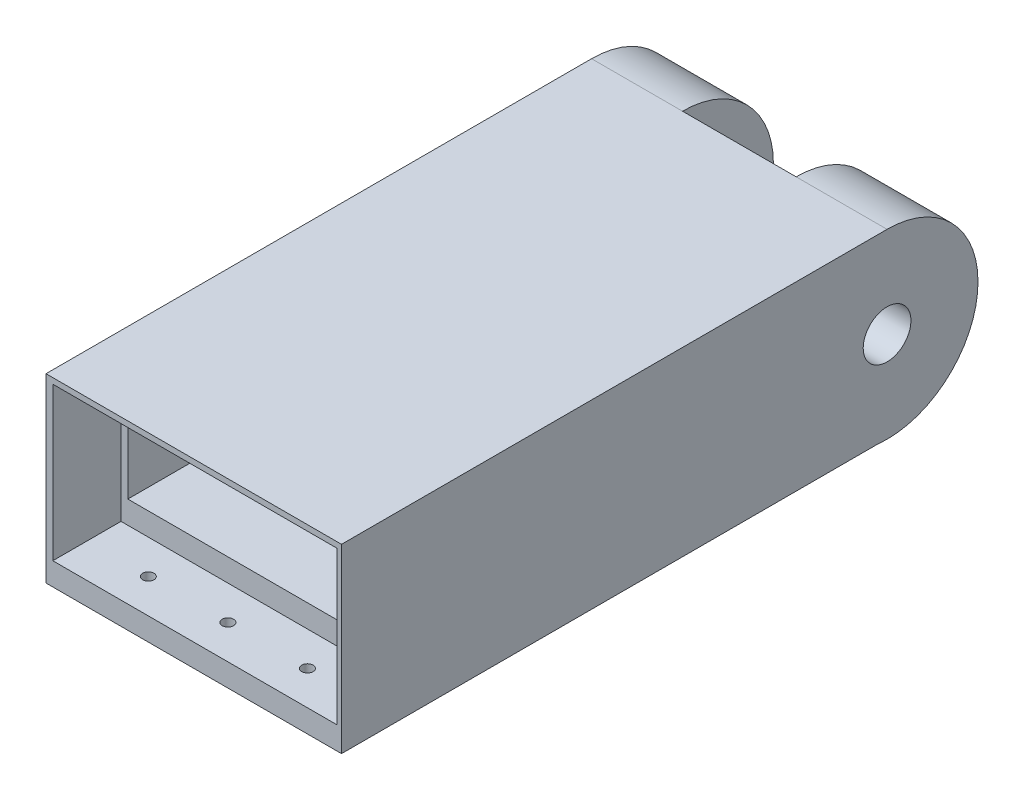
ISO-10303-21;
HEADER;
FILE_DESCRIPTION(('STEP AP214'),'2;1');
FILE_NAME('part.step','',(''),(''),'','','');
FILE_SCHEMA(('AUTOMOTIVE_DESIGN { 1 0 10303 214 1 1 1 1 }'));
ENDSEC;
DATA;
#1=APPLICATION_CONTEXT('core data for automotive mechanical design processes');
#2=APPLICATION_PROTOCOL_DEFINITION('international standard','automotive_design',2000,#1);
#3=PRODUCT_CONTEXT('',#1,'mechanical');
#4=PRODUCT('Part','Part','',(#3));
#5=PRODUCT_RELATED_PRODUCT_CATEGORY('part','',(#4));
#6=PRODUCT_DEFINITION_FORMATION('','',#4);
#7=PRODUCT_DEFINITION_CONTEXT('part definition',#1,'design');
#8=PRODUCT_DEFINITION('design','',#6,#7);
#9=PRODUCT_DEFINITION_SHAPE('','',#8);
#10=(LENGTH_UNIT() NAMED_UNIT(*) SI_UNIT(.MILLI.,.METRE.));
#11=(NAMED_UNIT(*) PLANE_ANGLE_UNIT() SI_UNIT($,.RADIAN.));
#12=(NAMED_UNIT(*) SI_UNIT($,.STERADIAN.) SOLID_ANGLE_UNIT());
#13=UNCERTAINTY_MEASURE_WITH_UNIT(LENGTH_MEASURE(1.E-05),#10,'distance_accuracy_value','');
#14=(GEOMETRIC_REPRESENTATION_CONTEXT(3) GLOBAL_UNCERTAINTY_ASSIGNED_CONTEXT((#13)) GLOBAL_UNIT_ASSIGNED_CONTEXT((#10,
#11,#12)) REPRESENTATION_CONTEXT('',''));
#15=CARTESIAN_POINT('',(0.,0.,0.));
#16=DIRECTION('',(0.,0.,1.));
#17=DIRECTION('',(1.,0.,0.));
#18=AXIS2_PLACEMENT_3D('',#15,#16,#17);
#19=CARTESIAN_POINT('',(7.69760634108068,102.517395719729,1190.00000000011));
#20=DIRECTION('',(-1.,0.,0.));
#21=DIRECTION('',(0.,0.,1.));
#22=AXIS2_PLACEMENT_3D('',#19,#20,#21);
#23=CYLINDRICAL_SURFACE('',#22,39.9999999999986);
#24=CARTESIAN_POINT('',(-32.3023936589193,102.517395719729,1190.00000000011));
#25=DIRECTION('',(1.,0.,0.));
#26=DIRECTION('',(0.,0.,1.));
#27=AXIS2_PLACEMENT_3D('',#24,#25,#26);
#28=CIRCLE('',#27,39.9999999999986);
#29=CARTESIAN_POINT('',(-32.3023936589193,62.7507169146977,1194.31407658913));
#30=VERTEX_POINT('',#29);
#31=CARTESIAN_POINT('',(-32.3023936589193,142.517395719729,1190.00000000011));
#32=VERTEX_POINT('',#31);
#33=EDGE_CURVE('E330',#30,#32,#28,.T.);
#34=ORIENTED_EDGE('',*,*,#33,.T.);
#35=DIRECTION('',(-1.,0.,0.));
#36=VECTOR('',#35,1.);
#37=CARTESIAN_POINT('',(7.69760634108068,142.517395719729,1190.00000000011));
#38=LINE('',#37,#36);
#39=CARTESIAN_POINT('',(7.69760634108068,142.517395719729,1190.00000000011));
#40=VERTEX_POINT('',#39);
#41=EDGE_CURVE('E12',#40,#32,#38,.T.);
#42=ORIENTED_EDGE('',*,*,#41,.F.);
#43=CARTESIAN_POINT('',(7.69760634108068,102.517395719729,1190.00000000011));
#44=DIRECTION('',(1.,0.,0.));
#45=DIRECTION('',(0.,0.,1.));
#46=AXIS2_PLACEMENT_3D('',#43,#44,#45);
#47=CIRCLE('',#46,39.9999999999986);
#48=CARTESIAN_POINT('',(7.69760634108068,62.7507169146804,1194.31407658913));
#49=VERTEX_POINT('',#48);
#50=EDGE_CURVE('E331',#49,#40,#47,.T.);
#51=ORIENTED_EDGE('',*,*,#50,.F.);
#52=DIRECTION('',(-1.,0.,0.));
#53=VECTOR('',#52,1.);
#54=CARTESIAN_POINT('',(7.69760634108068,62.7507169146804,1194.31407658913));
#55=LINE('',#54,#53);
#56=EDGE_CURVE('E49',#49,#30,#55,.T.);
#57=ORIENTED_EDGE('',*,*,#56,.T.);
#58=EDGE_LOOP('',(#34,#42,#51,#57));
#59=FACE_BOUND('',#58,.T.);
#60=ADVANCED_FACE('F41',(#59),#23,.T.);
#61=CARTESIAN_POINT('',(7.69760634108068,142.517395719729,1190.00000000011));
#62=DIRECTION('',(0.,-1.,0.));
#63=DIRECTION('',(0.,0.,-1.));
#64=AXIS2_PLACEMENT_3D('',#61,#62,#63);
#65=PLANE('',#64);
#66=ORIENTED_EDGE('',*,*,#41,.T.);
#67=DIRECTION('',(1.,0.,0.));
#68=VECTOR('',#67,1.);
#69=CARTESIAN_POINT('',(-82.3023936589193,142.51739571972,1190.00000000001));
#70=LINE('',#69,#68);
#71=CARTESIAN_POINT('',(-82.3023936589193,142.51739571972,1190.00000000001));
#72=VERTEX_POINT('',#71);
#73=EDGE_CURVE('E323',#72,#32,#70,.T.);
#74=ORIENTED_EDGE('',*,*,#73,.F.);
#75=DIRECTION('',(1.,0.,0.));
#76=VECTOR('',#75,1.);
#77=CARTESIAN_POINT('',(-122.302393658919,142.51739571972,1190.00000000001));
#78=LINE('',#77,#76);
#79=CARTESIAN_POINT('',(-122.302393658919,142.51739571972,1190.00000000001));
#80=VERTEX_POINT('',#79);
#81=EDGE_CURVE('E306',#80,#72,#78,.T.);
#82=ORIENTED_EDGE('',*,*,#81,.F.);
#83=DIRECTION('',(0.,0.,-1.));
#84=VECTOR('',#83,1.);
#85=CARTESIAN_POINT('',(-122.302393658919,142.51739571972,1190.00000000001));
#86=LINE('',#85,#84);
#87=CARTESIAN_POINT('',(-122.30239365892,142.51739571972,1430.00000000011));
#88=VERTEX_POINT('',#87);
#89=EDGE_CURVE('E304',#88,#80,#86,.T.);
#90=ORIENTED_EDGE('',*,*,#89,.F.);
#91=DIRECTION('',(-1.,0.,0.));
#92=VECTOR('',#91,1.);
#93=CARTESIAN_POINT('',(-122.30239365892,142.51739571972,1430.00000000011));
#94=LINE('',#93,#92);
#95=CARTESIAN_POINT('',(7.69760634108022,142.51739571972,1430.00000000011));
#96=VERTEX_POINT('',#95);
#97=EDGE_CURVE('E229',#96,#88,#94,.T.);
#98=ORIENTED_EDGE('',*,*,#97,.F.);
#99=DIRECTION('',(0.,0.,1.));
#100=VECTOR('',#99,1.);
#101=CARTESIAN_POINT('',(7.69760634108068,142.517395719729,1190.00000000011));
#102=LINE('',#101,#100);
#103=EDGE_CURVE('E334',#40,#96,#102,.T.);
#104=ORIENTED_EDGE('',*,*,#103,.F.);
#105=EDGE_LOOP('',(#66,#74,#82,#90,#98,#104));
#106=FACE_BOUND('',#105,.T.);
#107=ADVANCED_FACE('F358',(#106),#65,.F.);
#108=CARTESIAN_POINT('',(7.6976063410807,142.517395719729,1400.00000000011));
#109=DIRECTION('',(0.,0.,-1.));
#110=DIRECTION('',(-1.,0.,0.));
#111=AXIS2_PLACEMENT_3D('',#108,#109,#110);
#112=PLANE('',#111);
#113=DIRECTION('',(-1.,0.,0.));
#114=VECTOR('',#113,1.);
#115=CARTESIAN_POINT('',(-119.30239365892,140.01739571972,1400.00000000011));
#116=LINE('',#115,#114);
#117=CARTESIAN_POINT('',(5.77293715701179,140.01739571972,1400.00000000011));
#118=VERTEX_POINT('',#117);
#119=CARTESIAN_POINT('',(-119.30239365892,140.01739571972,1400.00000000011));
#120=VERTEX_POINT('',#119);
#121=EDGE_CURVE('E188',#118,#120,#116,.T.);
#122=ORIENTED_EDGE('',*,*,#121,.T.);
#123=DIRECTION('',(0.,-1.,0.));
#124=VECTOR('',#123,1.);
#125=CARTESIAN_POINT('',(-119.30239365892,140.01739571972,1400.00000000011));
#126=LINE('',#125,#124);
#127=CARTESIAN_POINT('',(-119.302393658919,72.7507169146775,1400.00000000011));
#128=VERTEX_POINT('',#127);
#129=EDGE_CURVE('E208',#120,#128,#126,.T.);
#130=ORIENTED_EDGE('',*,*,#129,.T.);
#131=DIRECTION('',(1.,0.,0.));
#132=VECTOR('',#131,1.);
#133=CARTESIAN_POINT('',(-119.302393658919,72.7507169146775,1400.00000000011));
#134=LINE('',#133,#132);
#135=CARTESIAN_POINT('',(5.7729371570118,72.7507169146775,1400.00000000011));
#136=VERTEX_POINT('',#135);
#137=EDGE_CURVE('E194',#128,#136,#134,.T.);
#138=ORIENTED_EDGE('',*,*,#137,.T.);
#139=DIRECTION('',(0.,1.,0.));
#140=VECTOR('',#139,1.);
#141=CARTESIAN_POINT('',(5.77293715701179,140.01739571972,1400.00000000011));
#142=LINE('',#141,#140);
#143=EDGE_CURVE('E212',#136,#118,#142,.T.);
#144=ORIENTED_EDGE('',*,*,#143,.T.);
#145=EDGE_LOOP('',(#122,#130,#138,#144));
#146=FACE_BOUND('',#145,.T.);
#147=DIRECTION('',(0.,-1.,0.));
#148=VECTOR('',#147,1.);
#149=CARTESIAN_POINT('',(-116.302393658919,82.7507169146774,1400.00000000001));
#150=LINE('',#149,#148);
#151=CARTESIAN_POINT('',(-116.302393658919,137.51739571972,1400.00000000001));
#152=VERTEX_POINT('',#151);
#153=CARTESIAN_POINT('',(-116.302393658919,82.7507169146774,1400.00000000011));
#154=VERTEX_POINT('',#153);
#155=EDGE_CURVE('E284',#152,#154,#150,.T.);
#156=ORIENTED_EDGE('',*,*,#155,.F.);
#157=DIRECTION('',(1.,0.,0.));
#158=VECTOR('',#157,1.);
#159=CARTESIAN_POINT('',(-339.326330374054,137.51739571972,1400.00000000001));
#160=LINE('',#159,#158);
#161=CARTESIAN_POINT('',(1.6976063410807,137.51739571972,1400.00000000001));
#162=VERTEX_POINT('',#161);
#163=EDGE_CURVE('E268',#152,#162,#160,.T.);
#164=ORIENTED_EDGE('',*,*,#163,.T.);
#165=DIRECTION('',(0.,-1.,0.));
#166=VECTOR('',#165,1.);
#167=CARTESIAN_POINT('',(1.6976063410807,82.7507169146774,1400.00000000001));
#168=LINE('',#167,#166);
#169=CARTESIAN_POINT('',(1.6976063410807,82.7507169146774,1400.00000000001));
#170=VERTEX_POINT('',#169);
#171=EDGE_CURVE('E258',#162,#170,#168,.T.);
#172=ORIENTED_EDGE('',*,*,#171,.T.);
#173=DIRECTION('',(1.,0.,0.));
#174=VECTOR('',#173,1.);
#175=CARTESIAN_POINT('',(-339.326330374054,82.7507169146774,1400.00000000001));
#176=LINE('',#175,#174);
#177=EDGE_CURVE('E283',#154,#170,#176,.T.);
#178=ORIENTED_EDGE('',*,*,#177,.F.);
#179=EDGE_LOOP('',(#156,#164,#172,#178));
#180=FACE_BOUND('',#179,.T.);
#181=ADVANCED_FACE('F398',(#146,#180),#112,.F.);
#182=CARTESIAN_POINT('',(7.6976063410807,62.7507169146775,1400.00000000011));
#183=DIRECTION('',(0.,1.,0.));
#184=DIRECTION('',(0.,0.,1.));
#185=AXIS2_PLACEMENT_3D('',#182,#183,#184);
#186=PLANE('',#185);
#187=CARTESIAN_POINT('',(-92.3023936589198,62.7507169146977,1415.00000000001));
#188=DIRECTION('',(0.,-1.,0.));
#189=DIRECTION('',(1.,0.,0.));
#190=AXIS2_PLACEMENT_3D('',#187,#188,#189);
#191=CIRCLE('',#190,5.49999999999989);
#192=CARTESIAN_POINT('',(-86.8023936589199,62.7507169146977,1415.00000000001));
#193=VERTEX_POINT('',#192);
#194=EDGE_CURVE('E476',#193,#193,#191,.T.);
#195=ORIENTED_EDGE('',*,*,#194,.F.);
#196=EDGE_LOOP('',(#195));
#197=FACE_BOUND('',#196,.T.);
#198=CARTESIAN_POINT('',(-57.3023936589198,62.7507169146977,1415.00000000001));
#199=DIRECTION('',(0.,-1.,0.));
#200=DIRECTION('',(1.,0.,0.));
#201=AXIS2_PLACEMENT_3D('',#198,#199,#200);
#202=CIRCLE('',#201,5.49999999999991);
#203=CARTESIAN_POINT('',(-51.8023936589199,62.7507169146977,1415.00000000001));
#204=VERTEX_POINT('',#203);
#205=EDGE_CURVE('E479',#204,#204,#202,.T.);
#206=ORIENTED_EDGE('',*,*,#205,.F.);
#207=EDGE_LOOP('',(#206));
#208=FACE_BOUND('',#207,.T.);
#209=CARTESIAN_POINT('',(-22.3023936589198,62.7507169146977,1415.00000000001));
#210=DIRECTION('',(0.,-1.,0.));
#211=DIRECTION('',(1.,0.,0.));
#212=AXIS2_PLACEMENT_3D('',#209,#210,#211);
#213=CIRCLE('',#212,5.49999999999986);
#214=CARTESIAN_POINT('',(-16.8023936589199,62.7507169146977,1415.00000000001));
#215=VERTEX_POINT('',#214);
#216=EDGE_CURVE('E485',#215,#215,#213,.T.);
#217=ORIENTED_EDGE('',*,*,#216,.F.);
#218=EDGE_LOOP('',(#217));
#219=FACE_BOUND('',#218,.T.);
#220=DIRECTION('',(1.,0.,0.));
#221=VECTOR('',#220,1.);
#222=CARTESIAN_POINT('',(-122.302393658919,62.7507169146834,1194.31407658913));
#223=LINE('',#222,#221);
#224=CARTESIAN_POINT('',(-122.302393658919,62.7507169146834,1194.31407658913));
#225=VERTEX_POINT('',#224);
#226=CARTESIAN_POINT('',(-82.3023936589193,62.7507169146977,1194.31407658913));
#227=VERTEX_POINT('',#226);
#228=EDGE_CURVE('E311',#225,#227,#223,.T.);
#229=ORIENTED_EDGE('',*,*,#228,.T.);
#230=DIRECTION('',(0.,0.,-1.));
#231=VECTOR('',#230,1.);
#232=CARTESIAN_POINT('',(-82.3023936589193,62.7507169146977,1194.31407658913));
#233=LINE('',#232,#231);
#234=CARTESIAN_POINT('',(-82.3023936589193,62.7507169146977,1234.31407658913));
#235=VERTEX_POINT('',#234);
#236=EDGE_CURVE('E236',#235,#227,#233,.T.);
#237=ORIENTED_EDGE('',*,*,#236,.F.);
#238=DIRECTION('',(-1.,0.,0.));
#239=VECTOR('',#238,1.);
#240=CARTESIAN_POINT('',(-82.3023936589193,62.7507169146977,1234.31407658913));
#241=LINE('',#240,#239);
#242=CARTESIAN_POINT('',(-32.3023936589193,62.7507169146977,1234.31407658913));
#243=VERTEX_POINT('',#242);
#244=EDGE_CURVE('E241',#243,#235,#241,.T.);
#245=ORIENTED_EDGE('',*,*,#244,.F.);
#246=DIRECTION('',(0.,0.,1.));
#247=VECTOR('',#246,1.);
#248=CARTESIAN_POINT('',(-32.3023936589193,62.7507169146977,1194.31407658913));
#249=LINE('',#248,#247);
#250=EDGE_CURVE('E238',#30,#243,#249,.T.);
#251=ORIENTED_EDGE('',*,*,#250,.F.);
#252=ORIENTED_EDGE('',*,*,#56,.F.);
#253=DIRECTION('',(0.,0.,-1.));
#254=VECTOR('',#253,1.);
#255=CARTESIAN_POINT('',(7.6976063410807,62.7507169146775,1400.00000000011));
#256=LINE('',#255,#254);
#257=CARTESIAN_POINT('',(7.6976063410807,62.7507169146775,1430.00000000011));
#258=VERTEX_POINT('',#257);
#259=EDGE_CURVE('E336',#258,#49,#256,.T.);
#260=ORIENTED_EDGE('',*,*,#259,.F.);
#261=DIRECTION('',(1.,0.,0.));
#262=VECTOR('',#261,1.);
#263=CARTESIAN_POINT('',(-122.302393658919,62.7507169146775,1430.00000000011));
#264=LINE('',#263,#262);
#265=CARTESIAN_POINT('',(-122.302393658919,62.7507169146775,1430.00000000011));
#266=VERTEX_POINT('',#265);
#267=EDGE_CURVE('E223',#266,#258,#264,.T.);
#268=ORIENTED_EDGE('',*,*,#267,.F.);
#269=DIRECTION('',(0.,0.,1.));
#270=VECTOR('',#269,1.);
#271=CARTESIAN_POINT('',(-122.302393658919,62.7507169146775,1400.00000000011));
#272=LINE('',#271,#270);
#273=EDGE_CURVE('E302',#225,#266,#272,.T.);
#274=ORIENTED_EDGE('',*,*,#273,.F.);
#275=EDGE_LOOP('',(#229,#237,#245,#251,#252,#260,#268,#274));
#276=FACE_BOUND('',#275,.T.);
#277=ADVANCED_FACE('F347',(#197,#208,#219,#276),#186,.F.);
#278=CARTESIAN_POINT('',(7.69760634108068,102.517395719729,1190.00000000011));
#279=DIRECTION('',(-1.,0.,0.));
#280=DIRECTION('',(0.,0.,1.));
#281=AXIS2_PLACEMENT_3D('',#278,#279,#280);
#282=PLANE('',#281);
#283=CARTESIAN_POINT('',(7.69760634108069,102.517395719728,1190.00000000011));
#284=DIRECTION('',(-1.,0.,0.));
#285=DIRECTION('',(0.,0.,1.));
#286=AXIS2_PLACEMENT_3D('',#283,#284,#285);
#287=CIRCLE('',#286,10.4999999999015);
#288=CARTESIAN_POINT('',(7.69760634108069,102.517395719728,1200.50000000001));
#289=VERTEX_POINT('',#288);
#290=EDGE_CURVE('E444',#289,#289,#287,.T.);
#291=ORIENTED_EDGE('',*,*,#290,.T.);
#292=EDGE_LOOP('',(#291));
#293=FACE_BOUND('',#292,.T.);
#294=ORIENTED_EDGE('',*,*,#50,.T.);
#295=ORIENTED_EDGE('',*,*,#103,.T.);
#296=DIRECTION('',(0.,1.,0.));
#297=VECTOR('',#296,1.);
#298=CARTESIAN_POINT('',(7.69760634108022,142.51739571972,1430.00000000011));
#299=LINE('',#298,#297);
#300=EDGE_CURVE('E226',#258,#96,#299,.T.);
#301=ORIENTED_EDGE('',*,*,#300,.F.);
#302=ORIENTED_EDGE('',*,*,#259,.T.);
#303=EDGE_LOOP('',(#294,#295,#301,#302));
#304=FACE_BOUND('',#303,.T.);
#305=ADVANCED_FACE('F364',(#293,#304),#282,.F.);
#306=CARTESIAN_POINT('',(-32.3023936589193,102.517395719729,1190.00000000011));
#307=DIRECTION('',(-1.,0.,0.));
#308=DIRECTION('',(0.,0.,1.));
#309=AXIS2_PLACEMENT_3D('',#306,#307,#308);
#310=PLANE('',#309);
#311=CARTESIAN_POINT('',(-32.3023936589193,102.517395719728,1190.00000000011));
#312=DIRECTION('',(-1.,0.,0.));
#313=DIRECTION('',(0.,0.,1.));
#314=AXIS2_PLACEMENT_3D('',#311,#312,#313);
#315=CIRCLE('',#314,10.4999999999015);
#316=CARTESIAN_POINT('',(-32.3023936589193,102.517395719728,1200.50000000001));
#317=VERTEX_POINT('',#316);
#318=EDGE_CURVE('E452',#317,#317,#315,.T.);
#319=ORIENTED_EDGE('',*,*,#318,.F.);
#320=EDGE_LOOP('',(#319));
#321=FACE_BOUND('',#320,.T.);
#322=DIRECTION('',(0.,-1.,0.));
#323=VECTOR('',#322,1.);
#324=CARTESIAN_POINT('',(-32.3023936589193,142.51739571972,1190.00000000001));
#325=LINE('',#324,#323);
#326=CARTESIAN_POINT('',(-32.3023936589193,137.51739571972,1190.00000000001));
#327=VERTEX_POINT('',#326);
#328=EDGE_CURVE('E319',#32,#327,#325,.T.);
#329=ORIENTED_EDGE('',*,*,#328,.F.);
#330=ORIENTED_EDGE('',*,*,#33,.F.);
#331=ORIENTED_EDGE('',*,*,#250,.T.);
#332=DIRECTION('',(0.,-1.,0.));
#333=VECTOR('',#332,1.);
#334=CARTESIAN_POINT('',(-32.3023936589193,142.518395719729,1234.31407658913));
#335=LINE('',#334,#333);
#336=CARTESIAN_POINT('',(-32.3023936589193,82.7507169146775,1234.31407658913));
#337=VERTEX_POINT('',#336);
#338=EDGE_CURVE('E244',#337,#243,#335,.T.);
#339=ORIENTED_EDGE('',*,*,#338,.F.);
#340=DIRECTION('',(0.,0.,-1.));
#341=VECTOR('',#340,1.);
#342=CARTESIAN_POINT('',(-32.3023936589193,82.7507169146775,1194.31407658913));
#343=LINE('',#342,#341);
#344=CARTESIAN_POINT('',(-32.3023936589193,82.7507169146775,1205.30615591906));
#345=VERTEX_POINT('',#344);
#346=EDGE_CURVE('E247',#337,#345,#343,.T.);
#347=ORIENTED_EDGE('',*,*,#346,.T.);
#348=CARTESIAN_POINT('',(-32.3023936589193,102.51739571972,1190.00000000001));
#349=DIRECTION('',(1.,0.,0.));
#350=DIRECTION('',(0.,0.,-1.));
#351=AXIS2_PLACEMENT_3D('',#348,#349,#350);
#352=CIRCLE('',#351,25.);
#353=CARTESIAN_POINT('',(-32.3023936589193,127.51739571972,1190.00000000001));
#354=VERTEX_POINT('',#353);
#355=EDGE_CURVE('E314',#354,#345,#352,.T.);
#356=ORIENTED_EDGE('',*,*,#355,.F.);
#357=DIRECTION('',(0.,-1.,0.));
#358=VECTOR('',#357,1.);
#359=CARTESIAN_POINT('',(-32.3023936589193,102.517395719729,1190.00000000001));
#360=LINE('',#359,#358);
#361=EDGE_CURVE('E295',#327,#354,#360,.T.);
#362=ORIENTED_EDGE('',*,*,#361,.F.);
#363=EDGE_LOOP('',(#329,#330,#331,#339,#347,#356,#362));
#364=FACE_BOUND('',#363,.T.);
#365=ADVANCED_FACE('F352',(#321,#364),#310,.T.);
#366=CARTESIAN_POINT('',(-82.3023936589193,142.51739571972,1190.00000000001));
#367=DIRECTION('',(0.,0.,1.));
#368=DIRECTION('',(1.,0.,0.));
#369=AXIS2_PLACEMENT_3D('',#366,#367,#368);
#370=PLANE('',#369);
#371=ORIENTED_EDGE('',*,*,#328,.T.);
#372=DIRECTION('',(1.,0.,0.));
#373=VECTOR('',#372,1.);
#374=CARTESIAN_POINT('',(-339.326330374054,137.51739571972,1190.00000000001));
#375=LINE('',#374,#373);
#376=CARTESIAN_POINT('',(-82.3023936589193,137.51739571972,1190.00000000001));
#377=VERTEX_POINT('',#376);
#378=EDGE_CURVE('E296',#377,#327,#375,.T.);
#379=ORIENTED_EDGE('',*,*,#378,.F.);
#380=DIRECTION('',(0.,-1.,0.));
#381=VECTOR('',#380,1.);
#382=CARTESIAN_POINT('',(-82.3023936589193,142.51739571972,1190.00000000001));
#383=LINE('',#382,#381);
#384=EDGE_CURVE('E320',#72,#377,#383,.T.);
#385=ORIENTED_EDGE('',*,*,#384,.F.);
#386=ORIENTED_EDGE('',*,*,#73,.T.);
#387=EDGE_LOOP('',(#371,#379,#385,#386));
#388=FACE_BOUND('',#387,.T.);
#389=ADVANCED_FACE('F411',(#388),#370,.F.);
#390=CARTESIAN_POINT('',(-122.302393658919,102.517395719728,1190.00000000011));
#391=DIRECTION('',(1.,0.,0.));
#392=DIRECTION('',(0.,0.,-1.));
#393=AXIS2_PLACEMENT_3D('',#390,#391,#392);
#394=CYLINDRICAL_SURFACE('',#393,39.9999999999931);
#395=CARTESIAN_POINT('',(-82.3023936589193,102.517395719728,1190.00000000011));
#396=DIRECTION('',(-1.,0.,0.));
#397=DIRECTION('',(0.,0.,1.));
#398=AXIS2_PLACEMENT_3D('',#395,#396,#397);
#399=CIRCLE('',#398,39.9999999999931);
#400=EDGE_CURVE('E298',#72,#227,#399,.T.);
#401=ORIENTED_EDGE('',*,*,#400,.T.);
#402=ORIENTED_EDGE('',*,*,#228,.F.);
#403=CARTESIAN_POINT('',(-122.302393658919,102.517395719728,1190.00000000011));
#404=DIRECTION('',(-1.,0.,0.));
#405=DIRECTION('',(0.,0.,1.));
#406=AXIS2_PLACEMENT_3D('',#403,#404,#405);
#407=CIRCLE('',#406,39.9999999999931);
#408=EDGE_CURVE('E299',#80,#225,#407,.T.);
#409=ORIENTED_EDGE('',*,*,#408,.F.);
#410=ORIENTED_EDGE('',*,*,#81,.T.);
#411=EDGE_LOOP('',(#401,#402,#409,#410));
#412=FACE_BOUND('',#411,.T.);
#413=ADVANCED_FACE('F372',(#412),#394,.T.);
#414=CARTESIAN_POINT('',(-122.302393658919,102.517395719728,1190.00000000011));
#415=DIRECTION('',(-1.,0.,0.));
#416=DIRECTION('',(0.,0.,1.));
#417=AXIS2_PLACEMENT_3D('',#414,#415,#416);
#418=PLANE('',#417);
#419=CARTESIAN_POINT('',(-122.302393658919,102.517395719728,1190.00000000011));
#420=DIRECTION('',(-1.,0.,0.));
#421=DIRECTION('',(0.,0.,1.));
#422=AXIS2_PLACEMENT_3D('',#419,#420,#421);
#423=CIRCLE('',#422,10.4999999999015);
#424=CARTESIAN_POINT('',(-122.302393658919,102.517395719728,1200.50000000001));
#425=VERTEX_POINT('',#424);
#426=EDGE_CURVE('E448',#425,#425,#423,.T.);
#427=ORIENTED_EDGE('',*,*,#426,.F.);
#428=EDGE_LOOP('',(#427));
#429=FACE_BOUND('',#428,.T.);
#430=ORIENTED_EDGE('',*,*,#408,.T.);
#431=ORIENTED_EDGE('',*,*,#273,.T.);
#432=DIRECTION('',(0.,-1.,0.));
#433=VECTOR('',#432,1.);
#434=CARTESIAN_POINT('',(-122.30239365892,142.51739571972,1430.00000000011));
#435=LINE('',#434,#433);
#436=EDGE_CURVE('E195',#88,#266,#435,.T.);
#437=ORIENTED_EDGE('',*,*,#436,.F.);
#438=ORIENTED_EDGE('',*,*,#89,.T.);
#439=EDGE_LOOP('',(#430,#431,#437,#438));
#440=FACE_BOUND('',#439,.T.);
#441=ADVANCED_FACE('F370',(#429,#440),#418,.T.);
#442=CARTESIAN_POINT('',(-82.3023936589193,102.517395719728,1190.00000000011));
#443=DIRECTION('',(-1.,0.,0.));
#444=DIRECTION('',(0.,0.,1.));
#445=AXIS2_PLACEMENT_3D('',#442,#443,#444);
#446=PLANE('',#445);
#447=CARTESIAN_POINT('',(-82.3023936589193,102.517395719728,1190.00000000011));
#448=DIRECTION('',(-1.,0.,0.));
#449=DIRECTION('',(0.,0.,1.));
#450=AXIS2_PLACEMENT_3D('',#447,#448,#449);
#451=CIRCLE('',#450,10.4999999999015);
#452=CARTESIAN_POINT('',(-82.3023936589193,102.517395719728,1200.50000000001));
#453=VERTEX_POINT('',#452);
#454=EDGE_CURVE('E44',#453,#453,#451,.T.);
#455=ORIENTED_EDGE('',*,*,#454,.T.);
#456=EDGE_LOOP('',(#455));
#457=FACE_BOUND('',#456,.T.);
#458=CARTESIAN_POINT('',(-82.3023936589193,102.51739571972,1190.00000000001));
#459=DIRECTION('',(1.,0.,0.));
#460=DIRECTION('',(0.,0.,-1.));
#461=AXIS2_PLACEMENT_3D('',#458,#459,#460);
#462=CIRCLE('',#461,25.);
#463=CARTESIAN_POINT('',(-82.3023936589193,127.51739571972,1190.00000000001));
#464=VERTEX_POINT('',#463);
#465=CARTESIAN_POINT('',(-82.3023936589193,82.7507169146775,1205.30615591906));
#466=VERTEX_POINT('',#465);
#467=EDGE_CURVE('E315',#464,#466,#462,.T.);
#468=ORIENTED_EDGE('',*,*,#467,.T.);
#469=DIRECTION('',(0.,0.,1.));
#470=VECTOR('',#469,1.);
#471=CARTESIAN_POINT('',(-82.3023936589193,82.7507169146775,1194.31407658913));
#472=LINE('',#471,#470);
#473=CARTESIAN_POINT('',(-82.3023936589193,82.7507169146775,1234.31407658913));
#474=VERTEX_POINT('',#473);
#475=EDGE_CURVE('E233',#466,#474,#472,.T.);
#476=ORIENTED_EDGE('',*,*,#475,.T.);
#477=DIRECTION('',(0.,-1.,0.));
#478=VECTOR('',#477,1.);
#479=CARTESIAN_POINT('',(-82.3023936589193,142.518395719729,1234.31407658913));
#480=LINE('',#479,#478);
#481=EDGE_CURVE('E245',#474,#235,#480,.T.);
#482=ORIENTED_EDGE('',*,*,#481,.T.);
#483=ORIENTED_EDGE('',*,*,#236,.T.);
#484=ORIENTED_EDGE('',*,*,#400,.F.);
#485=ORIENTED_EDGE('',*,*,#384,.T.);
#486=EDGE_CURVE('E318',#377,#464,#383,.T.);
#487=ORIENTED_EDGE('',*,*,#486,.T.);
#488=EDGE_LOOP('',(#468,#476,#482,#483,#484,#485,#487));
#489=FACE_BOUND('',#488,.T.);
#490=ADVANCED_FACE('F375',(#457,#489),#446,.F.);
#491=CARTESIAN_POINT('',(-339.326330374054,102.51739571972,1190.00000000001));
#492=DIRECTION('',(1.,0.,0.));
#493=DIRECTION('',(0.,0.,-1.));
#494=AXIS2_PLACEMENT_3D('',#491,#492,#493);
#495=CYLINDRICAL_SURFACE('',#494,25.);
#496=DIRECTION('',(1.,0.,0.));
#497=VECTOR('',#496,1.);
#498=CARTESIAN_POINT('',(-339.326330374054,127.51739571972,1190.00000000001));
#499=LINE('',#498,#497);
#500=CARTESIAN_POINT('',(-116.302393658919,127.51739571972,1190.00000000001));
#501=VERTEX_POINT('',#500);
#502=EDGE_CURVE('E273',#501,#464,#499,.T.);
#503=ORIENTED_EDGE('',*,*,#502,.F.);
#504=CARTESIAN_POINT('',(-116.302393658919,102.51739571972,1190.00000000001));
#505=DIRECTION('',(-1.,0.,0.));
#506=DIRECTION('',(0.,0.,1.));
#507=AXIS2_PLACEMENT_3D('',#504,#505,#506);
#508=CIRCLE('',#507,25.);
#509=CARTESIAN_POINT('',(-116.302393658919,82.7507169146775,1205.30615591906));
#510=VERTEX_POINT('',#509);
#511=EDGE_CURVE('E274',#510,#501,#508,.T.);
#512=ORIENTED_EDGE('',*,*,#511,.F.);
#513=DIRECTION('',(1.,0.,0.));
#514=VECTOR('',#513,1.);
#515=CARTESIAN_POINT('',(-339.326330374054,82.7507169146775,1205.30615591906));
#516=LINE('',#515,#514);
#517=EDGE_CURVE('E278',#510,#466,#516,.T.);
#518=ORIENTED_EDGE('',*,*,#517,.T.);
#519=ORIENTED_EDGE('',*,*,#467,.F.);
#520=EDGE_LOOP('',(#503,#512,#518,#519));
#521=FACE_BOUND('',#520,.T.);
#522=ADVANCED_FACE('F407',(#521),#495,.T.);
#523=CARTESIAN_POINT('',(-339.326330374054,127.51739571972,1190.00000000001));
#524=DIRECTION('',(0.,0.,-1.));
#525=DIRECTION('',(-1.,0.,0.));
#526=AXIS2_PLACEMENT_3D('',#523,#524,#525);
#527=PLANE('',#526);
#528=CARTESIAN_POINT('',(-116.302393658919,137.51739571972,1190.00000000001));
#529=VERTEX_POINT('',#528);
#530=EDGE_CURVE('E292',#529,#377,#375,.T.);
#531=ORIENTED_EDGE('',*,*,#530,.F.);
#532=DIRECTION('',(0.,1.,0.));
#533=VECTOR('',#532,1.);
#534=CARTESIAN_POINT('',(-116.302393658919,127.51739571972,1190.00000000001));
#535=LINE('',#534,#533);
#536=EDGE_CURVE('E269',#501,#529,#535,.T.);
#537=ORIENTED_EDGE('',*,*,#536,.F.);
#538=ORIENTED_EDGE('',*,*,#502,.T.);
#539=ORIENTED_EDGE('',*,*,#486,.F.);
#540=EDGE_LOOP('',(#531,#537,#538,#539));
#541=FACE_BOUND('',#540,.T.);
#542=ADVANCED_FACE('F410',(#541),#527,.F.);
#543=CARTESIAN_POINT('',(-116.302393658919,102.517395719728,1190.00000000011));
#544=DIRECTION('',(-1.,0.,0.));
#545=DIRECTION('',(0.,0.,1.));
#546=AXIS2_PLACEMENT_3D('',#543,#544,#545);
#547=PLANE('',#546);
#548=ORIENTED_EDGE('',*,*,#536,.T.);
#549=DIRECTION('',(0.,0.,1.));
#550=VECTOR('',#549,1.);
#551=CARTESIAN_POINT('',(-116.302393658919,137.51739571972,1190.00000000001));
#552=LINE('',#551,#550);
#553=EDGE_CURVE('E254',#529,#152,#552,.T.);
#554=ORIENTED_EDGE('',*,*,#553,.T.);
#555=ORIENTED_EDGE('',*,*,#155,.T.);
#556=DIRECTION('',(0.,0.,-1.));
#557=VECTOR('',#556,1.);
#558=CARTESIAN_POINT('',(-116.302393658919,82.7507169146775,1205.30615591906));
#559=LINE('',#558,#557);
#560=EDGE_CURVE('E279',#154,#510,#559,.T.);
#561=ORIENTED_EDGE('',*,*,#560,.T.);
#562=ORIENTED_EDGE('',*,*,#511,.T.);
#563=EDGE_LOOP('',(#548,#554,#555,#561,#562));
#564=FACE_BOUND('',#563,.T.);
#565=ADVANCED_FACE('F402',(#564),#547,.F.);
#566=CARTESIAN_POINT('',(1.69760634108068,102.51739571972,1190.00000000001));
#567=DIRECTION('',(1.,0.,0.));
#568=DIRECTION('',(0.,0.,-1.));
#569=AXIS2_PLACEMENT_3D('',#566,#567,#568);
#570=PLANE('',#569);
#571=DIRECTION('',(0.,1.,0.));
#572=VECTOR('',#571,1.);
#573=CARTESIAN_POINT('',(1.69760634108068,127.51739571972,1190.00000000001));
#574=LINE('',#573,#572);
#575=CARTESIAN_POINT('',(1.69760634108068,127.51739571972,1190.00000000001));
#576=VERTEX_POINT('',#575);
#577=CARTESIAN_POINT('',(1.69760634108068,137.51739571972,1190.00000000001));
#578=VERTEX_POINT('',#577);
#579=EDGE_CURVE('E250',#576,#578,#574,.T.);
#580=ORIENTED_EDGE('',*,*,#579,.F.);
#581=CARTESIAN_POINT('',(1.69760634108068,102.51739571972,1190.00000000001));
#582=DIRECTION('',(-1.,0.,0.));
#583=DIRECTION('',(0.,0.,-1.));
#584=AXIS2_PLACEMENT_3D('',#581,#582,#583);
#585=CIRCLE('',#584,25.);
#586=CARTESIAN_POINT('',(1.69760634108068,82.7507169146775,1205.30615591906));
#587=VERTEX_POINT('',#586);
#588=EDGE_CURVE('E251',#587,#576,#585,.T.);
#589=ORIENTED_EDGE('',*,*,#588,.F.);
#590=DIRECTION('',(0.,0.,-1.));
#591=VECTOR('',#590,1.);
#592=CARTESIAN_POINT('',(1.69760634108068,82.7507169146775,1205.30615591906));
#593=LINE('',#592,#591);
#594=EDGE_CURVE('E255',#170,#587,#593,.T.);
#595=ORIENTED_EDGE('',*,*,#594,.F.);
#596=ORIENTED_EDGE('',*,*,#171,.F.);
#597=DIRECTION('',(0.,0.,1.));
#598=VECTOR('',#597,1.);
#599=CARTESIAN_POINT('',(1.69760634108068,137.51739571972,1190.00000000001));
#600=LINE('',#599,#598);
#601=EDGE_CURVE('E261',#578,#162,#600,.T.);
#602=ORIENTED_EDGE('',*,*,#601,.F.);
#603=EDGE_LOOP('',(#580,#589,#595,#596,#602));
#604=FACE_BOUND('',#603,.T.);
#605=ADVANCED_FACE('F392',(#604),#570,.F.);
#606=CARTESIAN_POINT('',(-339.326330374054,137.51739571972,1190.00000000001));
#607=DIRECTION('',(0.,1.,0.));
#608=DIRECTION('',(0.,0.,1.));
#609=AXIS2_PLACEMENT_3D('',#606,#607,#608);
#610=PLANE('',#609);
#611=ORIENTED_EDGE('',*,*,#530,.T.);
#612=ORIENTED_EDGE('',*,*,#378,.T.);
#613=EDGE_CURVE('E272',#327,#578,#375,.T.);
#614=ORIENTED_EDGE('',*,*,#613,.T.);
#615=ORIENTED_EDGE('',*,*,#601,.T.);
#616=ORIENTED_EDGE('',*,*,#163,.F.);
#617=ORIENTED_EDGE('',*,*,#553,.F.);
#618=EDGE_LOOP('',(#611,#612,#614,#615,#616,#617));
#619=FACE_BOUND('',#618,.T.);
#620=ADVANCED_FACE('F394',(#619),#610,.F.);
#621=CARTESIAN_POINT('',(-339.326330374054,82.7507169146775,1205.30615591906));
#622=DIRECTION('',(0.,-1.,0.));
#623=DIRECTION('',(0.,0.,-1.));
#624=AXIS2_PLACEMENT_3D('',#621,#622,#623);
#625=PLANE('',#624);
#626=DIRECTION('',(1.,0.,0.));
#627=VECTOR('',#626,1.);
#628=CARTESIAN_POINT('',(-82.3023936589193,82.7507169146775,1234.31407658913));
#629=LINE('',#628,#627);
#630=EDGE_CURVE('E64',#474,#337,#629,.T.);
#631=ORIENTED_EDGE('',*,*,#630,.F.);
#632=ORIENTED_EDGE('',*,*,#475,.F.);
#633=ORIENTED_EDGE('',*,*,#517,.F.);
#634=ORIENTED_EDGE('',*,*,#560,.F.);
#635=ORIENTED_EDGE('',*,*,#177,.T.);
#636=ORIENTED_EDGE('',*,*,#594,.T.);
#637=EDGE_CURVE('E282',#345,#587,#516,.T.);
#638=ORIENTED_EDGE('',*,*,#637,.F.);
#639=ORIENTED_EDGE('',*,*,#346,.F.);
#640=EDGE_LOOP('',(#631,#632,#633,#634,#635,#636,#638,#639));
#641=FACE_BOUND('',#640,.T.);
#642=ADVANCED_FACE('F381',(#641),#625,.F.);
#643=ORIENTED_EDGE('',*,*,#355,.T.);
#644=ORIENTED_EDGE('',*,*,#637,.T.);
#645=ORIENTED_EDGE('',*,*,#588,.T.);
#646=EDGE_CURVE('E277',#354,#576,#499,.T.);
#647=ORIENTED_EDGE('',*,*,#646,.F.);
#648=EDGE_LOOP('',(#643,#644,#645,#647));
#649=FACE_BOUND('',#648,.T.);
#650=ADVANCED_FACE('F385',(#649),#495,.T.);
#651=ORIENTED_EDGE('',*,*,#361,.T.);
#652=ORIENTED_EDGE('',*,*,#646,.T.);
#653=ORIENTED_EDGE('',*,*,#579,.T.);
#654=ORIENTED_EDGE('',*,*,#613,.F.);
#655=EDGE_LOOP('',(#651,#652,#653,#654));
#656=FACE_BOUND('',#655,.T.);
#657=ADVANCED_FACE('F389',(#656),#527,.F.);
#658=CARTESIAN_POINT('',(-82.3023936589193,142.518395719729,1234.31407658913));
#659=DIRECTION('',(0.,0.,1.));
#660=DIRECTION('',(0.,-1.,0.));
#661=AXIS2_PLACEMENT_3D('',#658,#659,#660);
#662=PLANE('',#661);
#663=ORIENTED_EDGE('',*,*,#630,.T.);
#664=ORIENTED_EDGE('',*,*,#338,.T.);
#665=ORIENTED_EDGE('',*,*,#244,.T.);
#666=ORIENTED_EDGE('',*,*,#481,.F.);
#667=EDGE_LOOP('',(#663,#664,#665,#666));
#668=FACE_BOUND('',#667,.T.);
#669=ADVANCED_FACE('F377',(#668),#662,.F.);
#670=CARTESIAN_POINT('',(0.,0.,1430.00000000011));
#671=DIRECTION('',(0.,0.,1.));
#672=DIRECTION('',(1.,0.,0.));
#673=AXIS2_PLACEMENT_3D('',#670,#671,#672);
#674=PLANE('',#673);
#675=ORIENTED_EDGE('',*,*,#436,.T.);
#676=ORIENTED_EDGE('',*,*,#267,.T.);
#677=ORIENTED_EDGE('',*,*,#300,.T.);
#678=ORIENTED_EDGE('',*,*,#97,.T.);
#679=EDGE_LOOP('',(#675,#676,#677,#678));
#680=FACE_BOUND('',#679,.T.);
#681=DIRECTION('',(1.,0.,0.));
#682=VECTOR('',#681,1.);
#683=CARTESIAN_POINT('',(-119.302393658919,72.7507169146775,1430.00000000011));
#684=LINE('',#683,#682);
#685=CARTESIAN_POINT('',(-119.302393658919,72.7507169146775,1430.00000000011));
#686=VERTEX_POINT('',#685);
#687=CARTESIAN_POINT('',(5.7729371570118,72.7507169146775,1430.00000000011));
#688=VERTEX_POINT('',#687);
#689=EDGE_CURVE('E187',#686,#688,#684,.T.);
#690=ORIENTED_EDGE('',*,*,#689,.F.);
#691=DIRECTION('',(0.,-1.,0.));
#692=VECTOR('',#691,1.);
#693=CARTESIAN_POINT('',(-119.30239365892,140.01739571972,1430.00000000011));
#694=LINE('',#693,#692);
#695=CARTESIAN_POINT('',(-119.30239365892,140.01739571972,1430.00000000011));
#696=VERTEX_POINT('',#695);
#697=EDGE_CURVE('E179',#696,#686,#694,.T.);
#698=ORIENTED_EDGE('',*,*,#697,.F.);
#699=DIRECTION('',(-1.,0.,0.));
#700=VECTOR('',#699,1.);
#701=CARTESIAN_POINT('',(-119.30239365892,140.01739571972,1430.00000000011));
#702=LINE('',#701,#700);
#703=CARTESIAN_POINT('',(5.77293715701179,140.01739571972,1430.00000000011));
#704=VERTEX_POINT('',#703);
#705=EDGE_CURVE('E203',#704,#696,#702,.T.);
#706=ORIENTED_EDGE('',*,*,#705,.F.);
#707=DIRECTION('',(0.,1.,0.));
#708=VECTOR('',#707,1.);
#709=CARTESIAN_POINT('',(5.77293715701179,140.01739571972,1430.00000000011));
#710=LINE('',#709,#708);
#711=EDGE_CURVE('E201',#688,#704,#710,.T.);
#712=ORIENTED_EDGE('',*,*,#711,.F.);
#713=EDGE_LOOP('',(#690,#698,#706,#712));
#714=FACE_BOUND('',#713,.T.);
#715=ADVANCED_FACE('F199',(#680,#714),#674,.T.);
#716=CARTESIAN_POINT('',(-119.30239365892,140.01739571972,1430.00000000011));
#717=DIRECTION('',(1.,0.,0.));
#718=DIRECTION('',(0.,1.,0.));
#719=AXIS2_PLACEMENT_3D('',#716,#717,#718);
#720=PLANE('',#719);
#721=ORIENTED_EDGE('',*,*,#129,.F.);
#722=DIRECTION('',(0.,0.,-1.));
#723=VECTOR('',#722,1.);
#724=CARTESIAN_POINT('',(-119.30239365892,140.01739571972,1430.00000000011));
#725=LINE('',#724,#723);
#726=EDGE_CURVE('E56',#696,#120,#725,.T.);
#727=ORIENTED_EDGE('',*,*,#726,.F.);
#728=ORIENTED_EDGE('',*,*,#697,.T.);
#729=DIRECTION('',(0.,0.,-1.));
#730=VECTOR('',#729,1.);
#731=CARTESIAN_POINT('',(-119.302393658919,72.7507169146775,1430.00000000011));
#732=LINE('',#731,#730);
#733=EDGE_CURVE('E182',#686,#128,#732,.T.);
#734=ORIENTED_EDGE('',*,*,#733,.T.);
#735=EDGE_LOOP('',(#721,#727,#728,#734));
#736=FACE_BOUND('',#735,.T.);
#737=ADVANCED_FACE('F181',(#736),#720,.T.);
#738=CARTESIAN_POINT('',(-119.302393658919,72.7507169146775,1430.00000000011));
#739=DIRECTION('',(0.,1.,0.));
#740=DIRECTION('',(0.,0.,1.));
#741=AXIS2_PLACEMENT_3D('',#738,#739,#740);
#742=PLANE('',#741);
#743=CARTESIAN_POINT('',(-92.3023936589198,72.7507169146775,1415.00000000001));
#744=DIRECTION('',(0.,1.,0.));
#745=DIRECTION('',(0.,0.,1.));
#746=AXIS2_PLACEMENT_3D('',#743,#744,#745);
#747=CIRCLE('',#746,2.49999999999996);
#748=CARTESIAN_POINT('',(-92.3023936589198,72.7507169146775,1417.50000000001));
#749=VERTEX_POINT('',#748);
#750=EDGE_CURVE('E456',#749,#749,#747,.F.);
#751=ORIENTED_EDGE('',*,*,#750,.T.);
#752=EDGE_LOOP('',(#751));
#753=FACE_BOUND('',#752,.T.);
#754=CARTESIAN_POINT('',(-57.3023936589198,72.7507169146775,1415.00000000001));
#755=DIRECTION('',(0.,1.,0.));
#756=DIRECTION('',(0.,0.,1.));
#757=AXIS2_PLACEMENT_3D('',#754,#755,#756);
#758=CIRCLE('',#757,2.49999999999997);
#759=CARTESIAN_POINT('',(-57.3023936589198,72.7507169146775,1417.50000000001));
#760=VERTEX_POINT('',#759);
#761=EDGE_CURVE('E460',#760,#760,#758,.F.);
#762=ORIENTED_EDGE('',*,*,#761,.T.);
#763=EDGE_LOOP('',(#762));
#764=FACE_BOUND('',#763,.T.);
#765=CARTESIAN_POINT('',(-22.3023936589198,72.7507169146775,1415.00000000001));
#766=DIRECTION('',(0.,1.,0.));
#767=DIRECTION('',(0.,0.,1.));
#768=AXIS2_PLACEMENT_3D('',#765,#766,#767);
#769=CIRCLE('',#768,2.49999999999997);
#770=CARTESIAN_POINT('',(-22.3023936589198,72.7507169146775,1417.50000000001));
#771=VERTEX_POINT('',#770);
#772=EDGE_CURVE('E467',#771,#771,#769,.F.);
#773=ORIENTED_EDGE('',*,*,#772,.T.);
#774=EDGE_LOOP('',(#773));
#775=FACE_BOUND('',#774,.T.);
#776=ORIENTED_EDGE('',*,*,#137,.F.);
#777=ORIENTED_EDGE('',*,*,#733,.F.);
#778=ORIENTED_EDGE('',*,*,#689,.T.);
#779=DIRECTION('',(0.,0.,-1.));
#780=VECTOR('',#779,1.);
#781=CARTESIAN_POINT('',(5.7729371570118,72.7507169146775,1430.00000000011));
#782=LINE('',#781,#780);
#783=EDGE_CURVE('E196',#688,#136,#782,.T.);
#784=ORIENTED_EDGE('',*,*,#783,.T.);
#785=EDGE_LOOP('',(#776,#777,#778,#784));
#786=FACE_BOUND('',#785,.T.);
#787=ADVANCED_FACE('F191',(#753,#764,#775,#786),#742,.T.);
#788=CARTESIAN_POINT('',(5.77293715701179,140.01739571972,1430.00000000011));
#789=DIRECTION('',(-1.,0.,0.));
#790=DIRECTION('',(0.,-1.,0.));
#791=AXIS2_PLACEMENT_3D('',#788,#789,#790);
#792=PLANE('',#791);
#793=ORIENTED_EDGE('',*,*,#143,.F.);
#794=ORIENTED_EDGE('',*,*,#783,.F.);
#795=ORIENTED_EDGE('',*,*,#711,.T.);
#796=DIRECTION('',(0.,0.,-1.));
#797=VECTOR('',#796,1.);
#798=CARTESIAN_POINT('',(5.77293715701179,140.01739571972,1430.00000000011));
#799=LINE('',#798,#797);
#800=EDGE_CURVE('E218',#704,#118,#799,.T.);
#801=ORIENTED_EDGE('',*,*,#800,.T.);
#802=EDGE_LOOP('',(#793,#794,#795,#801));
#803=FACE_BOUND('',#802,.T.);
#804=ADVANCED_FACE('F507',(#803),#792,.T.);
#805=CARTESIAN_POINT('',(-119.30239365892,140.01739571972,1430.00000000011));
#806=DIRECTION('',(0.,-1.,0.));
#807=DIRECTION('',(0.,0.,-1.));
#808=AXIS2_PLACEMENT_3D('',#805,#806,#807);
#809=PLANE('',#808);
#810=ORIENTED_EDGE('',*,*,#121,.F.);
#811=ORIENTED_EDGE('',*,*,#800,.F.);
#812=ORIENTED_EDGE('',*,*,#705,.T.);
#813=ORIENTED_EDGE('',*,*,#726,.T.);
#814=EDGE_LOOP('',(#810,#811,#812,#813));
#815=FACE_BOUND('',#814,.T.);
#816=ADVANCED_FACE('F495',(#815),#809,.T.);
#817=CARTESIAN_POINT('',(-22.3023936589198,65.2507169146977,1415.00000000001));
#818=DIRECTION('',(0.,-1.,0.));
#819=DIRECTION('',(1.,0.,0.));
#820=AXIS2_PLACEMENT_3D('',#817,#818,#819);
#821=CYLINDRICAL_SURFACE('',#820,5.49999999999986);
#822=CARTESIAN_POINT('',(-22.3023936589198,65.2507169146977,1415.00000000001));
#823=DIRECTION('',(0.,-1.,0.));
#824=DIRECTION('',(1.,0.,0.));
#825=AXIS2_PLACEMENT_3D('',#822,#823,#824);
#826=CIRCLE('',#825,5.49999999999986);
#827=CARTESIAN_POINT('',(-16.8023936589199,65.2507169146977,1415.00000000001));
#828=VERTEX_POINT('',#827);
#829=EDGE_CURVE('E463',#828,#828,#826,.T.);
#830=ORIENTED_EDGE('',*,*,#829,.F.);
#831=EDGE_LOOP('',(#830));
#832=FACE_BOUND('',#831,.T.);
#833=ORIENTED_EDGE('',*,*,#216,.T.);
#834=EDGE_LOOP('',(#833));
#835=FACE_BOUND('',#834,.T.);
#836=ADVANCED_FACE('F492',(#832,#835),#821,.F.);
#837=CARTESIAN_POINT('',(-22.3023936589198,65.2507169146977,1415.00000000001));
#838=DIRECTION('',(0.,-1.,0.));
#839=DIRECTION('',(1.,0.,0.));
#840=AXIS2_PLACEMENT_3D('',#837,#838,#839);
#841=PLANE('',#840);
#842=CARTESIAN_POINT('',(-22.3023936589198,65.2507169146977,1415.00000000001));
#843=DIRECTION('',(0.,-1.,0.));
#844=DIRECTION('',(1.,0.,0.));
#845=AXIS2_PLACEMENT_3D('',#842,#843,#844);
#846=CIRCLE('',#845,2.49999999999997);
#847=CARTESIAN_POINT('',(-19.8023936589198,65.2507169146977,1415.00000000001));
#848=VERTEX_POINT('',#847);
#849=EDGE_CURVE('E455',#848,#848,#846,.T.);
#850=ORIENTED_EDGE('',*,*,#849,.F.);
#851=EDGE_LOOP('',(#850));
#852=FACE_BOUND('',#851,.T.);
#853=ORIENTED_EDGE('',*,*,#829,.T.);
#854=EDGE_LOOP('',(#853));
#855=FACE_BOUND('',#854,.T.);
#856=ADVANCED_FACE('F490',(#852,#855),#841,.T.);
#857=CARTESIAN_POINT('',(-57.3023936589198,65.2507169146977,1415.00000000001));
#858=DIRECTION('',(0.,-1.,0.));
#859=DIRECTION('',(1.,0.,0.));
#860=AXIS2_PLACEMENT_3D('',#857,#858,#859);
#861=CYLINDRICAL_SURFACE('',#860,5.49999999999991);
#862=CARTESIAN_POINT('',(-57.3023936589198,65.2507169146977,1415.00000000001));
#863=DIRECTION('',(0.,-1.,0.));
#864=DIRECTION('',(1.,0.,0.));
#865=AXIS2_PLACEMENT_3D('',#862,#863,#864);
#866=CIRCLE('',#865,5.49999999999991);
#867=CARTESIAN_POINT('',(-51.8023936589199,65.2507169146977,1415.00000000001));
#868=VERTEX_POINT('',#867);
#869=EDGE_CURVE('E482',#868,#868,#866,.T.);
#870=ORIENTED_EDGE('',*,*,#869,.F.);
#871=EDGE_LOOP('',(#870));
#872=FACE_BOUND('',#871,.T.);
#873=ORIENTED_EDGE('',*,*,#205,.T.);
#874=EDGE_LOOP('',(#873));
#875=FACE_BOUND('',#874,.T.);
#876=ADVANCED_FACE('F503',(#872,#875),#861,.F.);
#877=CARTESIAN_POINT('',(-57.3023936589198,65.2507169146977,1415.00000000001));
#878=DIRECTION('',(0.,-1.,0.));
#879=DIRECTION('',(1.,0.,0.));
#880=AXIS2_PLACEMENT_3D('',#877,#878,#879);
#881=PLANE('',#880);
#882=CARTESIAN_POINT('',(-57.3023936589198,65.2507169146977,1415.00000000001));
#883=DIRECTION('',(0.,-1.,0.));
#884=DIRECTION('',(1.,0.,0.));
#885=AXIS2_PLACEMENT_3D('',#882,#883,#884);
#886=CIRCLE('',#885,2.49999999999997);
#887=CARTESIAN_POINT('',(-54.8023936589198,65.2507169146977,1415.00000000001));
#888=VERTEX_POINT('',#887);
#889=EDGE_CURVE('E464',#888,#888,#886,.T.);
#890=ORIENTED_EDGE('',*,*,#889,.F.);
#891=EDGE_LOOP('',(#890));
#892=FACE_BOUND('',#891,.T.);
#893=ORIENTED_EDGE('',*,*,#869,.T.);
#894=EDGE_LOOP('',(#893));
#895=FACE_BOUND('',#894,.T.);
#896=ADVANCED_FACE('F510',(#892,#895),#881,.T.);
#897=CARTESIAN_POINT('',(-92.3023936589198,65.2507169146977,1415.00000000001));
#898=DIRECTION('',(0.,-1.,0.));
#899=DIRECTION('',(1.,0.,0.));
#900=AXIS2_PLACEMENT_3D('',#897,#898,#899);
#901=CYLINDRICAL_SURFACE('',#900,5.49999999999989);
#902=CARTESIAN_POINT('',(-92.3023936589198,65.2507169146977,1415.00000000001));
#903=DIRECTION('',(0.,-1.,0.));
#904=DIRECTION('',(1.,0.,0.));
#905=AXIS2_PLACEMENT_3D('',#902,#903,#904);
#906=CIRCLE('',#905,5.49999999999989);
#907=CARTESIAN_POINT('',(-86.8023936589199,65.2507169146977,1415.00000000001));
#908=VERTEX_POINT('',#907);
#909=EDGE_CURVE('E210',#908,#908,#906,.T.);
#910=ORIENTED_EDGE('',*,*,#909,.F.);
#911=EDGE_LOOP('',(#910));
#912=FACE_BOUND('',#911,.T.);
#913=ORIENTED_EDGE('',*,*,#194,.T.);
#914=EDGE_LOOP('',(#913));
#915=FACE_BOUND('',#914,.T.);
#916=ADVANCED_FACE('F569',(#912,#915),#901,.F.);
#917=CARTESIAN_POINT('',(-92.3023936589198,65.2507169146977,1415.00000000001));
#918=DIRECTION('',(0.,-1.,0.));
#919=DIRECTION('',(1.,0.,0.));
#920=AXIS2_PLACEMENT_3D('',#917,#918,#919);
#921=PLANE('',#920);
#922=CARTESIAN_POINT('',(-92.3023936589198,65.2507169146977,1415.00000000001));
#923=DIRECTION('',(0.,-1.,0.));
#924=DIRECTION('',(1.,0.,0.));
#925=AXIS2_PLACEMENT_3D('',#922,#923,#924);
#926=CIRCLE('',#925,2.49999999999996);
#927=CARTESIAN_POINT('',(-89.8023936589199,65.2507169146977,1415.00000000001));
#928=VERTEX_POINT('',#927);
#929=EDGE_CURVE('E459',#928,#928,#926,.T.);
#930=ORIENTED_EDGE('',*,*,#929,.F.);
#931=EDGE_LOOP('',(#930));
#932=FACE_BOUND('',#931,.T.);
#933=ORIENTED_EDGE('',*,*,#909,.T.);
#934=EDGE_LOOP('',(#933));
#935=FACE_BOUND('',#934,.T.);
#936=ADVANCED_FACE('F565',(#932,#935),#921,.T.);
#937=CARTESIAN_POINT('',(-22.3023936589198,142.518395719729,1415.00000000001));
#938=DIRECTION('',(0.,-1.,0.));
#939=DIRECTION('',(1.,0.,0.));
#940=AXIS2_PLACEMENT_3D('',#937,#938,#939);
#941=CYLINDRICAL_SURFACE('',#940,2.49999999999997);
#942=ORIENTED_EDGE('',*,*,#772,.F.);
#943=EDGE_LOOP('',(#942));
#944=FACE_BOUND('',#943,.T.);
#945=ORIENTED_EDGE('',*,*,#849,.T.);
#946=EDGE_LOOP('',(#945));
#947=FACE_BOUND('',#946,.T.);
#948=ADVANCED_FACE('F561',(#944,#947),#941,.F.);
#949=CARTESIAN_POINT('',(-57.3023936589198,142.518395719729,1415.00000000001));
#950=DIRECTION('',(0.,-1.,0.));
#951=DIRECTION('',(1.,0.,0.));
#952=AXIS2_PLACEMENT_3D('',#949,#950,#951);
#953=CYLINDRICAL_SURFACE('',#952,2.49999999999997);
#954=ORIENTED_EDGE('',*,*,#761,.F.);
#955=EDGE_LOOP('',(#954));
#956=FACE_BOUND('',#955,.T.);
#957=ORIENTED_EDGE('',*,*,#889,.T.);
#958=EDGE_LOOP('',(#957));
#959=FACE_BOUND('',#958,.T.);
#960=ADVANCED_FACE('F555',(#956,#959),#953,.F.);
#961=CARTESIAN_POINT('',(-92.3023936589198,142.518395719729,1415.00000000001));
#962=DIRECTION('',(0.,-1.,0.));
#963=DIRECTION('',(1.,0.,0.));
#964=AXIS2_PLACEMENT_3D('',#961,#962,#963);
#965=CYLINDRICAL_SURFACE('',#964,2.49999999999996);
#966=ORIENTED_EDGE('',*,*,#750,.F.);
#967=EDGE_LOOP('',(#966));
#968=FACE_BOUND('',#967,.T.);
#969=ORIENTED_EDGE('',*,*,#929,.T.);
#970=EDGE_LOOP('',(#969));
#971=FACE_BOUND('',#970,.T.);
#972=ADVANCED_FACE('F548',(#968,#971),#965,.F.);
#973=CARTESIAN_POINT('',(7.69760634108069,102.517395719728,1190.00000000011));
#974=DIRECTION('',(-1.,0.,0.));
#975=DIRECTION('',(0.,0.,1.));
#976=AXIS2_PLACEMENT_3D('',#973,#974,#975);
#977=CYLINDRICAL_SURFACE('',#976,10.4999999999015);
#978=ORIENTED_EDGE('',*,*,#426,.T.);
#979=EDGE_LOOP('',(#978));
#980=FACE_BOUND('',#979,.T.);
#981=ORIENTED_EDGE('',*,*,#454,.F.);
#982=EDGE_LOOP('',(#981));
#983=FACE_BOUND('',#982,.T.);
#984=ADVANCED_FACE('F546',(#980,#983),#977,.F.);
#985=ORIENTED_EDGE('',*,*,#318,.T.);
#986=EDGE_LOOP('',(#985));
#987=FACE_BOUND('',#986,.T.);
#988=ORIENTED_EDGE('',*,*,#290,.F.);
#989=EDGE_LOOP('',(#988));
#990=FACE_BOUND('',#989,.T.);
#991=ADVANCED_FACE('F547',(#987,#990),#977,.F.);
#992=CLOSED_SHELL('',(#60,#107,#181,#277,#305,#365,#389,#413,#441,#490,#522,#542,#565,#605,#620,
#642,#650,#657,#669,#715,#737,#787,#804,#816,#836,#856,#876,#896,#916,#936,#948,#960,#972,#984,#991));
#993=MANIFOLD_SOLID_BREP('B2',#992);
#994=ADVANCED_BREP_SHAPE_REPRESENTATION('',(#18,#993),#14);
#995=SHAPE_DEFINITION_REPRESENTATION(#9,#994);
ENDSEC;
END-ISO-10303-21;
